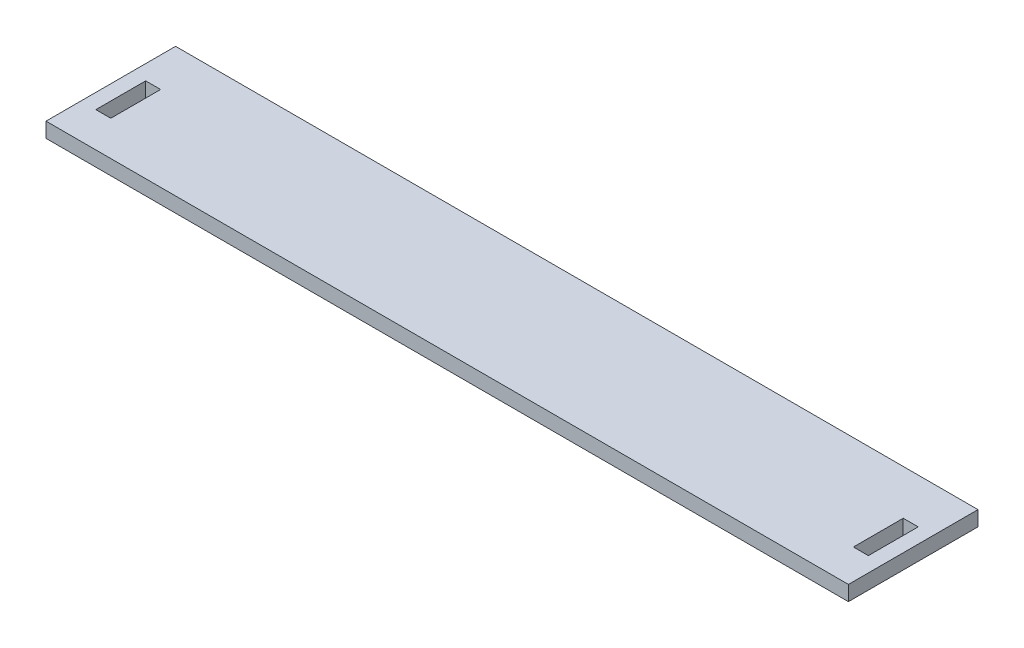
ISO-10303-21;
HEADER;
FILE_DESCRIPTION(('STEP AP214'),'2;1');
FILE_NAME('part.step','',(''),(''),'','','');
FILE_SCHEMA(('AUTOMOTIVE_DESIGN { 1 0 10303 214 1 1 1 1 }'));
ENDSEC;
DATA;
#1=APPLICATION_CONTEXT('core data for automotive mechanical design processes');
#2=APPLICATION_PROTOCOL_DEFINITION('international standard','automotive_design',2000,#1);
#3=PRODUCT_CONTEXT('',#1,'mechanical');
#4=PRODUCT('Part','Part','',(#3));
#5=PRODUCT_RELATED_PRODUCT_CATEGORY('part','',(#4));
#6=PRODUCT_DEFINITION_FORMATION('','',#4);
#7=PRODUCT_DEFINITION_CONTEXT('part definition',#1,'design');
#8=PRODUCT_DEFINITION('design','',#6,#7);
#9=PRODUCT_DEFINITION_SHAPE('','',#8);
#10=(LENGTH_UNIT() NAMED_UNIT(*) SI_UNIT(.MILLI.,.METRE.));
#11=(NAMED_UNIT(*) PLANE_ANGLE_UNIT() SI_UNIT($,.RADIAN.));
#12=(NAMED_UNIT(*) SI_UNIT($,.STERADIAN.) SOLID_ANGLE_UNIT());
#13=UNCERTAINTY_MEASURE_WITH_UNIT(LENGTH_MEASURE(1.E-05),#10,'distance_accuracy_value','');
#14=(GEOMETRIC_REPRESENTATION_CONTEXT(3) GLOBAL_UNCERTAINTY_ASSIGNED_CONTEXT((#13)) GLOBAL_UNIT_ASSIGNED_CONTEXT((#10,
#11,#12)) REPRESENTATION_CONTEXT('',''));
#15=CARTESIAN_POINT('',(0.,0.,0.));
#16=DIRECTION('',(0.,0.,1.));
#17=DIRECTION('',(1.,0.,0.));
#18=AXIS2_PLACEMENT_3D('',#15,#16,#17);
#19=CARTESIAN_POINT('',(0.,3.,0.));
#20=DIRECTION('',(0.,1.,0.));
#21=DIRECTION('',(0.,0.,1.));
#22=AXIS2_PLACEMENT_3D('',#19,#20,#21);
#23=PLANE('',#22);
#24=DIRECTION('',(0.,0.,-1.));
#25=VECTOR('',#24,1.);
#26=CARTESIAN_POINT('',(80.5,3.,-13.));
#27=LINE('',#26,#25);
#28=CARTESIAN_POINT('',(80.5,3.,13.));
#29=VERTEX_POINT('',#28);
#30=CARTESIAN_POINT('',(80.5,3.,-13.));
#31=VERTEX_POINT('',#30);
#32=EDGE_CURVE('E189',#29,#31,#27,.T.);
#33=ORIENTED_EDGE('',*,*,#32,.T.);
#34=DIRECTION('',(-1.,0.,0.));
#35=VECTOR('',#34,1.);
#36=CARTESIAN_POINT('',(-80.5,3.,-13.));
#37=LINE('',#36,#35);
#38=CARTESIAN_POINT('',(-80.5,3.,-13.));
#39=VERTEX_POINT('',#38);
#40=EDGE_CURVE('E192',#31,#39,#37,.T.);
#41=ORIENTED_EDGE('',*,*,#40,.T.);
#42=DIRECTION('',(0.,0.,1.));
#43=VECTOR('',#42,1.);
#44=CARTESIAN_POINT('',(-80.5,3.,-13.));
#45=LINE('',#44,#43);
#46=CARTESIAN_POINT('',(-80.5,3.,13.));
#47=VERTEX_POINT('',#46);
#48=EDGE_CURVE('E195',#39,#47,#45,.T.);
#49=ORIENTED_EDGE('',*,*,#48,.T.);
#50=DIRECTION('',(1.,0.,0.));
#51=VECTOR('',#50,1.);
#52=CARTESIAN_POINT('',(-80.5,3.,13.));
#53=LINE('',#52,#51);
#54=EDGE_CURVE('E197',#47,#29,#53,.T.);
#55=ORIENTED_EDGE('',*,*,#54,.T.);
#56=EDGE_LOOP('',(#33,#41,#49,#55));
#57=FACE_BOUND('',#56,.T.);
#58=DIRECTION('',(-1.,0.,0.));
#59=VECTOR('',#58,1.);
#60=CARTESIAN_POINT('',(-77.5,3.,-4.));
#61=LINE('',#60,#59);
#62=CARTESIAN_POINT('',(-74.5,3.,-4.));
#63=VERTEX_POINT('',#62);
#64=CARTESIAN_POINT('',(-77.5,3.,-4.));
#65=VERTEX_POINT('',#64);
#66=EDGE_CURVE('E160',#63,#65,#61,.T.);
#67=ORIENTED_EDGE('',*,*,#66,.F.);
#68=DIRECTION('',(0.,0.,-1.));
#69=VECTOR('',#68,1.);
#70=CARTESIAN_POINT('',(-74.5,3.,6.));
#71=LINE('',#70,#69);
#72=CARTESIAN_POINT('',(-74.5,3.,6.));
#73=VERTEX_POINT('',#72);
#74=EDGE_CURVE('E158',#73,#63,#71,.T.);
#75=ORIENTED_EDGE('',*,*,#74,.F.);
#76=DIRECTION('',(1.,0.,0.));
#77=VECTOR('',#76,1.);
#78=CARTESIAN_POINT('',(-77.5,3.,6.));
#79=LINE('',#78,#77);
#80=CARTESIAN_POINT('',(-77.5,3.,6.));
#81=VERTEX_POINT('',#80);
#82=EDGE_CURVE('E166',#81,#73,#79,.T.);
#83=ORIENTED_EDGE('',*,*,#82,.F.);
#84=DIRECTION('',(0.,0.,1.));
#85=VECTOR('',#84,1.);
#86=CARTESIAN_POINT('',(-77.5,3.,6.));
#87=LINE('',#86,#85);
#88=EDGE_CURVE('E163',#65,#81,#87,.T.);
#89=ORIENTED_EDGE('',*,*,#88,.F.);
#90=EDGE_LOOP('',(#67,#75,#83,#89));
#91=FACE_BOUND('',#90,.T.);
#92=DIRECTION('',(-1.,0.,0.));
#93=VECTOR('',#92,1.);
#94=CARTESIAN_POINT('',(77.5,3.,-4.));
#95=LINE('',#94,#93);
#96=CARTESIAN_POINT('',(77.5,3.,-4.));
#97=VERTEX_POINT('',#96);
#98=CARTESIAN_POINT('',(74.5,3.,-4.));
#99=VERTEX_POINT('',#98);
#100=EDGE_CURVE('E130',#97,#99,#95,.T.);
#101=ORIENTED_EDGE('',*,*,#100,.F.);
#102=DIRECTION('',(0.,0.,-1.));
#103=VECTOR('',#102,1.);
#104=CARTESIAN_POINT('',(77.5,3.,6.));
#105=LINE('',#104,#103);
#106=CARTESIAN_POINT('',(77.5,3.,6.));
#107=VERTEX_POINT('',#106);
#108=EDGE_CURVE('E122',#107,#97,#105,.T.);
#109=ORIENTED_EDGE('',*,*,#108,.F.);
#110=DIRECTION('',(1.,0.,0.));
#111=VECTOR('',#110,1.);
#112=CARTESIAN_POINT('',(77.5,3.,6.));
#113=LINE('',#112,#111);
#114=CARTESIAN_POINT('',(74.5,3.,6.));
#115=VERTEX_POINT('',#114);
#116=EDGE_CURVE('E144',#115,#107,#113,.T.);
#117=ORIENTED_EDGE('',*,*,#116,.F.);
#118=DIRECTION('',(0.,0.,1.));
#119=VECTOR('',#118,1.);
#120=CARTESIAN_POINT('',(74.5,3.,6.));
#121=LINE('',#120,#119);
#122=EDGE_CURVE('E142',#99,#115,#121,.T.);
#123=ORIENTED_EDGE('',*,*,#122,.F.);
#124=EDGE_LOOP('',(#101,#109,#117,#123));
#125=FACE_BOUND('',#124,.T.);
#126=ADVANCED_FACE('F33',(#57,#91,#125),#23,.T.);
#127=CARTESIAN_POINT('',(0.,0.,0.));
#128=DIRECTION('',(0.,1.,0.));
#129=DIRECTION('',(0.,0.,1.));
#130=AXIS2_PLACEMENT_3D('',#127,#128,#129);
#131=PLANE('',#130);
#132=DIRECTION('',(0.,0.,-1.));
#133=VECTOR('',#132,1.);
#134=CARTESIAN_POINT('',(-74.5,0.,6.));
#135=LINE('',#134,#133);
#136=CARTESIAN_POINT('',(-74.5,0.,6.));
#137=VERTEX_POINT('',#136);
#138=CARTESIAN_POINT('',(-74.5,0.,-4.));
#139=VERTEX_POINT('',#138);
#140=EDGE_CURVE('E138',#137,#139,#135,.T.);
#141=ORIENTED_EDGE('',*,*,#140,.T.);
#142=DIRECTION('',(-1.,0.,0.));
#143=VECTOR('',#142,1.);
#144=CARTESIAN_POINT('',(-77.5,0.,-4.));
#145=LINE('',#144,#143);
#146=CARTESIAN_POINT('',(-77.5,0.,-4.));
#147=VERTEX_POINT('',#146);
#148=EDGE_CURVE('E171',#139,#147,#145,.T.);
#149=ORIENTED_EDGE('',*,*,#148,.T.);
#150=DIRECTION('',(0.,0.,1.));
#151=VECTOR('',#150,1.);
#152=CARTESIAN_POINT('',(-77.5,0.,6.));
#153=LINE('',#152,#151);
#154=CARTESIAN_POINT('',(-77.5,0.,6.));
#155=VERTEX_POINT('',#154);
#156=EDGE_CURVE('E174',#147,#155,#153,.T.);
#157=ORIENTED_EDGE('',*,*,#156,.T.);
#158=DIRECTION('',(1.,0.,0.));
#159=VECTOR('',#158,1.);
#160=CARTESIAN_POINT('',(-77.5,0.,6.));
#161=LINE('',#160,#159);
#162=EDGE_CURVE('E161',#155,#137,#161,.T.);
#163=ORIENTED_EDGE('',*,*,#162,.T.);
#164=EDGE_LOOP('',(#141,#149,#157,#163));
#165=FACE_BOUND('',#164,.T.);
#166=DIRECTION('',(0.,0.,-1.));
#167=VECTOR('',#166,1.);
#168=CARTESIAN_POINT('',(80.5,0.,-13.));
#169=LINE('',#168,#167);
#170=CARTESIAN_POINT('',(80.5,0.,13.));
#171=VERTEX_POINT('',#170);
#172=CARTESIAN_POINT('',(80.5,0.,-13.));
#173=VERTEX_POINT('',#172);
#174=EDGE_CURVE('E188',#171,#173,#169,.T.);
#175=ORIENTED_EDGE('',*,*,#174,.F.);
#176=DIRECTION('',(1.,0.,0.));
#177=VECTOR('',#176,1.);
#178=CARTESIAN_POINT('',(-80.5,0.,13.));
#179=LINE('',#178,#177);
#180=CARTESIAN_POINT('',(-80.5,0.,13.));
#181=VERTEX_POINT('',#180);
#182=EDGE_CURVE('E193',#181,#171,#179,.T.);
#183=ORIENTED_EDGE('',*,*,#182,.F.);
#184=DIRECTION('',(0.,0.,1.));
#185=VECTOR('',#184,1.);
#186=CARTESIAN_POINT('',(-80.5,0.,-13.));
#187=LINE('',#186,#185);
#188=CARTESIAN_POINT('',(-80.5,0.,-13.));
#189=VERTEX_POINT('',#188);
#190=EDGE_CURVE('E204',#189,#181,#187,.T.);
#191=ORIENTED_EDGE('',*,*,#190,.F.);
#192=DIRECTION('',(-1.,0.,0.));
#193=VECTOR('',#192,1.);
#194=CARTESIAN_POINT('',(-80.5,0.,-13.));
#195=LINE('',#194,#193);
#196=EDGE_CURVE('E202',#173,#189,#195,.T.);
#197=ORIENTED_EDGE('',*,*,#196,.F.);
#198=EDGE_LOOP('',(#175,#183,#191,#197));
#199=FACE_BOUND('',#198,.T.);
#200=DIRECTION('',(0.,0.,-1.));
#201=VECTOR('',#200,1.);
#202=CARTESIAN_POINT('',(77.5,0.,6.));
#203=LINE('',#202,#201);
#204=CARTESIAN_POINT('',(77.5,0.,6.));
#205=VERTEX_POINT('',#204);
#206=CARTESIAN_POINT('',(77.5,0.,-4.));
#207=VERTEX_POINT('',#206);
#208=EDGE_CURVE('E56',#205,#207,#203,.T.);
#209=ORIENTED_EDGE('',*,*,#208,.T.);
#210=DIRECTION('',(-1.,0.,0.));
#211=VECTOR('',#210,1.);
#212=CARTESIAN_POINT('',(77.5,0.,-4.));
#213=LINE('',#212,#211);
#214=CARTESIAN_POINT('',(74.5,0.,-4.));
#215=VERTEX_POINT('',#214);
#216=EDGE_CURVE('E137',#207,#215,#213,.T.);
#217=ORIENTED_EDGE('',*,*,#216,.T.);
#218=DIRECTION('',(0.,0.,1.));
#219=VECTOR('',#218,1.);
#220=CARTESIAN_POINT('',(74.5,0.,6.));
#221=LINE('',#220,#219);
#222=CARTESIAN_POINT('',(74.5,0.,6.));
#223=VERTEX_POINT('',#222);
#224=EDGE_CURVE('E150',#215,#223,#221,.T.);
#225=ORIENTED_EDGE('',*,*,#224,.T.);
#226=DIRECTION('',(1.,0.,0.));
#227=VECTOR('',#226,1.);
#228=CARTESIAN_POINT('',(77.5,0.,6.));
#229=LINE('',#228,#227);
#230=EDGE_CURVE('E131',#223,#205,#229,.T.);
#231=ORIENTED_EDGE('',*,*,#230,.T.);
#232=EDGE_LOOP('',(#209,#217,#225,#231));
#233=FACE_BOUND('',#232,.T.);
#234=ADVANCED_FACE('F222',(#165,#199,#233),#131,.F.);
#235=CARTESIAN_POINT('',(80.5,3.,-13.));
#236=DIRECTION('',(-1.,0.,0.));
#237=DIRECTION('',(0.,0.,1.));
#238=AXIS2_PLACEMENT_3D('',#235,#236,#237);
#239=PLANE('',#238);
#240=ORIENTED_EDGE('',*,*,#174,.T.);
#241=DIRECTION('',(0.,-1.,0.));
#242=VECTOR('',#241,1.);
#243=CARTESIAN_POINT('',(80.5,3.,-13.));
#244=LINE('',#243,#242);
#245=EDGE_CURVE('E11',#31,#173,#244,.T.);
#246=ORIENTED_EDGE('',*,*,#245,.F.);
#247=ORIENTED_EDGE('',*,*,#32,.F.);
#248=DIRECTION('',(0.,-1.,0.));
#249=VECTOR('',#248,1.);
#250=CARTESIAN_POINT('',(80.5,3.,13.));
#251=LINE('',#250,#249);
#252=EDGE_CURVE('E199',#29,#171,#251,.T.);
#253=ORIENTED_EDGE('',*,*,#252,.T.);
#254=EDGE_LOOP('',(#240,#246,#247,#253));
#255=FACE_BOUND('',#254,.T.);
#256=ADVANCED_FACE('F35',(#255),#239,.F.);
#257=CARTESIAN_POINT('',(-80.5,3.,-13.));
#258=DIRECTION('',(0.,0.,1.));
#259=DIRECTION('',(1.,0.,0.));
#260=AXIS2_PLACEMENT_3D('',#257,#258,#259);
#261=PLANE('',#260);
#262=ORIENTED_EDGE('',*,*,#196,.T.);
#263=DIRECTION('',(0.,-1.,0.));
#264=VECTOR('',#263,1.);
#265=CARTESIAN_POINT('',(-80.5,3.,-13.));
#266=LINE('',#265,#264);
#267=EDGE_CURVE('E41',#39,#189,#266,.T.);
#268=ORIENTED_EDGE('',*,*,#267,.F.);
#269=ORIENTED_EDGE('',*,*,#40,.F.);
#270=ORIENTED_EDGE('',*,*,#245,.T.);
#271=EDGE_LOOP('',(#262,#268,#269,#270));
#272=FACE_BOUND('',#271,.T.);
#273=ADVANCED_FACE('F233',(#272),#261,.F.);
#274=CARTESIAN_POINT('',(-80.5,3.,-13.));
#275=DIRECTION('',(1.,0.,0.));
#276=DIRECTION('',(0.,0.,-1.));
#277=AXIS2_PLACEMENT_3D('',#274,#275,#276);
#278=PLANE('',#277);
#279=ORIENTED_EDGE('',*,*,#190,.T.);
#280=DIRECTION('',(0.,-1.,0.));
#281=VECTOR('',#280,1.);
#282=CARTESIAN_POINT('',(-80.5,3.,13.));
#283=LINE('',#282,#281);
#284=EDGE_CURVE('E209',#47,#181,#283,.T.);
#285=ORIENTED_EDGE('',*,*,#284,.F.);
#286=ORIENTED_EDGE('',*,*,#48,.F.);
#287=ORIENTED_EDGE('',*,*,#267,.T.);
#288=EDGE_LOOP('',(#279,#285,#286,#287));
#289=FACE_BOUND('',#288,.T.);
#290=ADVANCED_FACE('F216',(#289),#278,.F.);
#291=CARTESIAN_POINT('',(-80.5,3.,13.));
#292=DIRECTION('',(0.,0.,-1.));
#293=DIRECTION('',(-1.,0.,0.));
#294=AXIS2_PLACEMENT_3D('',#291,#292,#293);
#295=PLANE('',#294);
#296=ORIENTED_EDGE('',*,*,#182,.T.);
#297=ORIENTED_EDGE('',*,*,#252,.F.);
#298=ORIENTED_EDGE('',*,*,#54,.F.);
#299=ORIENTED_EDGE('',*,*,#284,.T.);
#300=EDGE_LOOP('',(#296,#297,#298,#299));
#301=FACE_BOUND('',#300,.T.);
#302=ADVANCED_FACE('F226',(#301),#295,.F.);
#303=CARTESIAN_POINT('',(-74.5,3.,6.));
#304=DIRECTION('',(-1.,0.,0.));
#305=DIRECTION('',(0.,0.,1.));
#306=AXIS2_PLACEMENT_3D('',#303,#304,#305);
#307=PLANE('',#306);
#308=ORIENTED_EDGE('',*,*,#140,.F.);
#309=DIRECTION('',(0.,-1.,0.));
#310=VECTOR('',#309,1.);
#311=CARTESIAN_POINT('',(-74.5,3.,6.));
#312=LINE('',#311,#310);
#313=EDGE_CURVE('E168',#73,#137,#312,.T.);
#314=ORIENTED_EDGE('',*,*,#313,.F.);
#315=ORIENTED_EDGE('',*,*,#74,.T.);
#316=DIRECTION('',(0.,-1.,0.));
#317=VECTOR('',#316,1.);
#318=CARTESIAN_POINT('',(-74.5,3.,-4.));
#319=LINE('',#318,#317);
#320=EDGE_CURVE('E185',#63,#139,#319,.T.);
#321=ORIENTED_EDGE('',*,*,#320,.T.);
#322=EDGE_LOOP('',(#308,#314,#315,#321));
#323=FACE_BOUND('',#322,.T.);
#324=ADVANCED_FACE('F248',(#323),#307,.T.);
#325=CARTESIAN_POINT('',(-77.5,3.,-4.));
#326=DIRECTION('',(0.,0.,1.));
#327=DIRECTION('',(1.,0.,0.));
#328=AXIS2_PLACEMENT_3D('',#325,#326,#327);
#329=PLANE('',#328);
#330=ORIENTED_EDGE('',*,*,#148,.F.);
#331=ORIENTED_EDGE('',*,*,#320,.F.);
#332=ORIENTED_EDGE('',*,*,#66,.T.);
#333=DIRECTION('',(0.,-1.,0.));
#334=VECTOR('',#333,1.);
#335=CARTESIAN_POINT('',(-77.5,3.,-4.));
#336=LINE('',#335,#334);
#337=EDGE_CURVE('E183',#65,#147,#336,.T.);
#338=ORIENTED_EDGE('',*,*,#337,.T.);
#339=EDGE_LOOP('',(#330,#331,#332,#338));
#340=FACE_BOUND('',#339,.T.);
#341=ADVANCED_FACE('F255',(#340),#329,.T.);
#342=CARTESIAN_POINT('',(-77.5,3.,6.));
#343=DIRECTION('',(1.,0.,0.));
#344=DIRECTION('',(0.,0.,-1.));
#345=AXIS2_PLACEMENT_3D('',#342,#343,#344);
#346=PLANE('',#345);
#347=ORIENTED_EDGE('',*,*,#156,.F.);
#348=ORIENTED_EDGE('',*,*,#337,.F.);
#349=ORIENTED_EDGE('',*,*,#88,.T.);
#350=DIRECTION('',(0.,-1.,0.));
#351=VECTOR('',#350,1.);
#352=CARTESIAN_POINT('',(-77.5,3.,6.));
#353=LINE('',#352,#351);
#354=EDGE_CURVE('E181',#81,#155,#353,.T.);
#355=ORIENTED_EDGE('',*,*,#354,.T.);
#356=EDGE_LOOP('',(#347,#348,#349,#355));
#357=FACE_BOUND('',#356,.T.);
#358=ADVANCED_FACE('F260',(#357),#346,.T.);
#359=CARTESIAN_POINT('',(-77.5,3.,6.));
#360=DIRECTION('',(0.,0.,-1.));
#361=DIRECTION('',(-1.,0.,0.));
#362=AXIS2_PLACEMENT_3D('',#359,#360,#361);
#363=PLANE('',#362);
#364=ORIENTED_EDGE('',*,*,#162,.F.);
#365=ORIENTED_EDGE('',*,*,#354,.F.);
#366=ORIENTED_EDGE('',*,*,#82,.T.);
#367=ORIENTED_EDGE('',*,*,#313,.T.);
#368=EDGE_LOOP('',(#364,#365,#366,#367));
#369=FACE_BOUND('',#368,.T.);
#370=ADVANCED_FACE('F267',(#369),#363,.T.);
#371=CARTESIAN_POINT('',(77.5,3.,6.));
#372=DIRECTION('',(-1.,0.,0.));
#373=DIRECTION('',(0.,0.,1.));
#374=AXIS2_PLACEMENT_3D('',#371,#372,#373);
#375=PLANE('',#374);
#376=ORIENTED_EDGE('',*,*,#208,.F.);
#377=DIRECTION('',(0.,-1.,0.));
#378=VECTOR('',#377,1.);
#379=CARTESIAN_POINT('',(77.5,3.,6.));
#380=LINE('',#379,#378);
#381=EDGE_CURVE('E126',#107,#205,#380,.T.);
#382=ORIENTED_EDGE('',*,*,#381,.F.);
#383=ORIENTED_EDGE('',*,*,#108,.T.);
#384=DIRECTION('',(0.,-1.,0.));
#385=VECTOR('',#384,1.);
#386=CARTESIAN_POINT('',(77.5,3.,-4.));
#387=LINE('',#386,#385);
#388=EDGE_CURVE('E125',#97,#207,#387,.T.);
#389=ORIENTED_EDGE('',*,*,#388,.T.);
#390=EDGE_LOOP('',(#376,#382,#383,#389));
#391=FACE_BOUND('',#390,.T.);
#392=ADVANCED_FACE('F124',(#391),#375,.T.);
#393=CARTESIAN_POINT('',(77.5,3.,-4.));
#394=DIRECTION('',(0.,0.,1.));
#395=DIRECTION('',(1.,0.,0.));
#396=AXIS2_PLACEMENT_3D('',#393,#394,#395);
#397=PLANE('',#396);
#398=ORIENTED_EDGE('',*,*,#216,.F.);
#399=ORIENTED_EDGE('',*,*,#388,.F.);
#400=ORIENTED_EDGE('',*,*,#100,.T.);
#401=DIRECTION('',(0.,-1.,0.));
#402=VECTOR('',#401,1.);
#403=CARTESIAN_POINT('',(74.5,3.,-4.));
#404=LINE('',#403,#402);
#405=EDGE_CURVE('E139',#99,#215,#404,.T.);
#406=ORIENTED_EDGE('',*,*,#405,.T.);
#407=EDGE_LOOP('',(#398,#399,#400,#406));
#408=FACE_BOUND('',#407,.T.);
#409=ADVANCED_FACE('F134',(#408),#397,.T.);
#410=CARTESIAN_POINT('',(74.5,3.,6.));
#411=DIRECTION('',(1.,0.,0.));
#412=DIRECTION('',(0.,0.,-1.));
#413=AXIS2_PLACEMENT_3D('',#410,#411,#412);
#414=PLANE('',#413);
#415=ORIENTED_EDGE('',*,*,#224,.F.);
#416=ORIENTED_EDGE('',*,*,#405,.F.);
#417=ORIENTED_EDGE('',*,*,#122,.T.);
#418=DIRECTION('',(0.,-1.,0.));
#419=VECTOR('',#418,1.);
#420=CARTESIAN_POINT('',(74.5,3.,6.));
#421=LINE('',#420,#419);
#422=EDGE_CURVE('E48',#115,#223,#421,.T.);
#423=ORIENTED_EDGE('',*,*,#422,.T.);
#424=EDGE_LOOP('',(#415,#416,#417,#423));
#425=FACE_BOUND('',#424,.T.);
#426=ADVANCED_FACE('F285',(#425),#414,.T.);
#427=CARTESIAN_POINT('',(77.5,3.,6.));
#428=DIRECTION('',(0.,0.,-1.));
#429=DIRECTION('',(-1.,0.,0.));
#430=AXIS2_PLACEMENT_3D('',#427,#428,#429);
#431=PLANE('',#430);
#432=ORIENTED_EDGE('',*,*,#230,.F.);
#433=ORIENTED_EDGE('',*,*,#422,.F.);
#434=ORIENTED_EDGE('',*,*,#116,.T.);
#435=ORIENTED_EDGE('',*,*,#381,.T.);
#436=EDGE_LOOP('',(#432,#433,#434,#435));
#437=FACE_BOUND('',#436,.T.);
#438=ADVANCED_FACE('F288',(#437),#431,.T.);
#439=CLOSED_SHELL('',(#126,#234,#256,#273,#290,#302,#324,#341,#358,#370,#392,#409,#426,#438));
#440=MANIFOLD_SOLID_BREP('B2',#439);
#441=ADVANCED_BREP_SHAPE_REPRESENTATION('',(#18,#440),#14);
#442=SHAPE_DEFINITION_REPRESENTATION(#9,#441);
ENDSEC;
END-ISO-10303-21;
